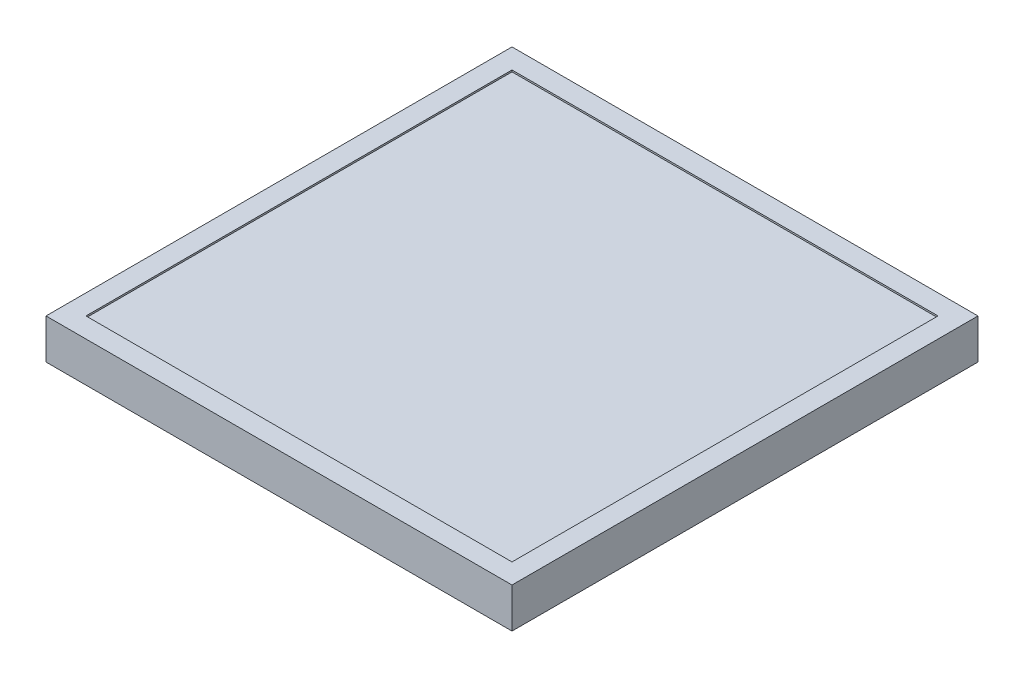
ISO-10303-21;
HEADER;
FILE_DESCRIPTION(('STEP AP214'),'2;1');
FILE_NAME('part.step','',(''),(''),'','','');
FILE_SCHEMA(('AUTOMOTIVE_DESIGN { 1 0 10303 214 1 1 1 1 }'));
ENDSEC;
DATA;
#1=APPLICATION_CONTEXT('core data for automotive mechanical design processes');
#2=APPLICATION_PROTOCOL_DEFINITION('international standard','automotive_design',2000,#1);
#3=PRODUCT_CONTEXT('',#1,'mechanical');
#4=PRODUCT('Part','Part','',(#3));
#5=PRODUCT_RELATED_PRODUCT_CATEGORY('part','',(#4));
#6=PRODUCT_DEFINITION_FORMATION('','',#4);
#7=PRODUCT_DEFINITION_CONTEXT('part definition',#1,'design');
#8=PRODUCT_DEFINITION('design','',#6,#7);
#9=PRODUCT_DEFINITION_SHAPE('','',#8);
#10=(LENGTH_UNIT() NAMED_UNIT(*) SI_UNIT(.MILLI.,.METRE.));
#11=(NAMED_UNIT(*) PLANE_ANGLE_UNIT() SI_UNIT($,.RADIAN.));
#12=(NAMED_UNIT(*) SI_UNIT($,.STERADIAN.) SOLID_ANGLE_UNIT());
#13=UNCERTAINTY_MEASURE_WITH_UNIT(LENGTH_MEASURE(1.E-05),#10,'distance_accuracy_value','');
#14=(GEOMETRIC_REPRESENTATION_CONTEXT(3) GLOBAL_UNCERTAINTY_ASSIGNED_CONTEXT((#13)) GLOBAL_UNIT_ASSIGNED_CONTEXT((#10,
#11,#12)) REPRESENTATION_CONTEXT('',''));
#15=CARTESIAN_POINT('',(0.,0.,0.));
#16=DIRECTION('',(0.,0.,1.));
#17=DIRECTION('',(1.,0.,0.));
#18=AXIS2_PLACEMENT_3D('',#15,#16,#17);
#19=CARTESIAN_POINT('',(144.143471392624,24.,145.254894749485));
#20=DIRECTION('',(-1.,0.,0.));
#21=DIRECTION('',(0.,0.,1.));
#22=AXIS2_PLACEMENT_3D('',#19,#20,#21);
#23=PLANE('',#22);
#24=DIRECTION('',(0.,0.,-1.));
#25=VECTOR('',#24,1.);
#26=CARTESIAN_POINT('',(144.143471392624,0.,145.254894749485));
#27=LINE('',#26,#25);
#28=CARTESIAN_POINT('',(144.143471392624,0.,145.254894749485));
#29=VERTEX_POINT('',#28);
#30=CARTESIAN_POINT('',(144.143471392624,0.,-134.745105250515));
#31=VERTEX_POINT('',#30);
#32=EDGE_CURVE('E158',#29,#31,#27,.T.);
#33=ORIENTED_EDGE('',*,*,#32,.T.);
#34=DIRECTION('',(0.,-1.,0.));
#35=VECTOR('',#34,1.);
#36=CARTESIAN_POINT('',(144.143471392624,24.,-134.745105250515));
#37=LINE('',#36,#35);
#38=CARTESIAN_POINT('',(144.143471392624,24.,-134.745105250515));
#39=VERTEX_POINT('',#38);
#40=EDGE_CURVE('E11',#39,#31,#37,.T.);
#41=ORIENTED_EDGE('',*,*,#40,.F.);
#42=DIRECTION('',(0.,0.,-1.));
#43=VECTOR('',#42,1.);
#44=CARTESIAN_POINT('',(144.143471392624,24.,145.254894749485));
#45=LINE('',#44,#43);
#46=CARTESIAN_POINT('',(144.143471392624,24.,145.254894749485));
#47=VERTEX_POINT('',#46);
#48=EDGE_CURVE('E164',#47,#39,#45,.T.);
#49=ORIENTED_EDGE('',*,*,#48,.F.);
#50=DIRECTION('',(0.,-1.,0.));
#51=VECTOR('',#50,1.);
#52=CARTESIAN_POINT('',(144.143471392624,24.,145.254894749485));
#53=LINE('',#52,#51);
#54=EDGE_CURVE('E174',#47,#29,#53,.T.);
#55=ORIENTED_EDGE('',*,*,#54,.T.);
#56=EDGE_LOOP('',(#33,#41,#49,#55));
#57=FACE_BOUND('',#56,.T.);
#58=ADVANCED_FACE('F39',(#57),#23,.F.);
#59=CARTESIAN_POINT('',(-135.856528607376,24.,-134.745105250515));
#60=DIRECTION('',(0.,0.,1.));
#61=DIRECTION('',(1.,0.,0.));
#62=AXIS2_PLACEMENT_3D('',#59,#60,#61);
#63=PLANE('',#62);
#64=DIRECTION('',(-1.,0.,0.));
#65=VECTOR('',#64,1.);
#66=CARTESIAN_POINT('',(-135.856528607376,0.,-134.745105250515));
#67=LINE('',#66,#65);
#68=CARTESIAN_POINT('',(-135.856528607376,0.,-134.745105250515));
#69=VERTEX_POINT('',#68);
#70=EDGE_CURVE('E178',#31,#69,#67,.T.);
#71=ORIENTED_EDGE('',*,*,#70,.T.);
#72=DIRECTION('',(0.,-1.,0.));
#73=VECTOR('',#72,1.);
#74=CARTESIAN_POINT('',(-135.856528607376,24.,-134.745105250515));
#75=LINE('',#74,#73);
#76=CARTESIAN_POINT('',(-135.856528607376,24.,-134.745105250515));
#77=VERTEX_POINT('',#76);
#78=EDGE_CURVE('E47',#77,#69,#75,.T.);
#79=ORIENTED_EDGE('',*,*,#78,.F.);
#80=DIRECTION('',(-1.,0.,0.));
#81=VECTOR('',#80,1.);
#82=CARTESIAN_POINT('',(-135.856528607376,24.,-134.745105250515));
#83=LINE('',#82,#81);
#84=EDGE_CURVE('E91',#39,#77,#83,.T.);
#85=ORIENTED_EDGE('',*,*,#84,.F.);
#86=ORIENTED_EDGE('',*,*,#40,.T.);
#87=EDGE_LOOP('',(#71,#79,#85,#86));
#88=FACE_BOUND('',#87,.T.);
#89=ADVANCED_FACE('F213',(#88),#63,.F.);
#90=CARTESIAN_POINT('',(-135.856528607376,24.,145.254894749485));
#91=DIRECTION('',(1.,0.,0.));
#92=DIRECTION('',(0.,0.,-1.));
#93=AXIS2_PLACEMENT_3D('',#90,#91,#92);
#94=PLANE('',#93);
#95=DIRECTION('',(0.,0.,1.));
#96=VECTOR('',#95,1.);
#97=CARTESIAN_POINT('',(-135.856528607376,0.,145.254894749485));
#98=LINE('',#97,#96);
#99=CARTESIAN_POINT('',(-135.856528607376,0.,145.254894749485));
#100=VERTEX_POINT('',#99);
#101=EDGE_CURVE('E181',#69,#100,#98,.T.);
#102=ORIENTED_EDGE('',*,*,#101,.T.);
#103=DIRECTION('',(0.,-1.,0.));
#104=VECTOR('',#103,1.);
#105=CARTESIAN_POINT('',(-135.856528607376,24.,145.254894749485));
#106=LINE('',#105,#104);
#107=CARTESIAN_POINT('',(-135.856528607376,24.,145.254894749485));
#108=VERTEX_POINT('',#107);
#109=EDGE_CURVE('E188',#108,#100,#106,.T.);
#110=ORIENTED_EDGE('',*,*,#109,.F.);
#111=DIRECTION('',(0.,0.,1.));
#112=VECTOR('',#111,1.);
#113=CARTESIAN_POINT('',(-135.856528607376,24.,145.254894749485));
#114=LINE('',#113,#112);
#115=EDGE_CURVE('E169',#77,#108,#114,.T.);
#116=ORIENTED_EDGE('',*,*,#115,.F.);
#117=ORIENTED_EDGE('',*,*,#78,.T.);
#118=EDGE_LOOP('',(#102,#110,#116,#117));
#119=FACE_BOUND('',#118,.T.);
#120=ADVANCED_FACE('F195',(#119),#94,.F.);
#121=CARTESIAN_POINT('',(-135.856528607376,24.,145.254894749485));
#122=DIRECTION('',(0.,0.,-1.));
#123=DIRECTION('',(-1.,0.,0.));
#124=AXIS2_PLACEMENT_3D('',#121,#122,#123);
#125=PLANE('',#124);
#126=DIRECTION('',(1.,0.,0.));
#127=VECTOR('',#126,1.);
#128=CARTESIAN_POINT('',(-135.856528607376,0.,145.254894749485));
#129=LINE('',#128,#127);
#130=EDGE_CURVE('E84',#100,#29,#129,.T.);
#131=ORIENTED_EDGE('',*,*,#130,.T.);
#132=ORIENTED_EDGE('',*,*,#54,.F.);
#133=DIRECTION('',(1.,0.,0.));
#134=VECTOR('',#133,1.);
#135=CARTESIAN_POINT('',(-135.856528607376,24.,145.254894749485));
#136=LINE('',#135,#134);
#137=EDGE_CURVE('E63',#108,#47,#136,.T.);
#138=ORIENTED_EDGE('',*,*,#137,.F.);
#139=ORIENTED_EDGE('',*,*,#109,.T.);
#140=EDGE_LOOP('',(#131,#132,#138,#139));
#141=FACE_BOUND('',#140,.T.);
#142=ADVANCED_FACE('F203',(#141),#125,.F.);
#143=CARTESIAN_POINT('',(0.,24.,0.));
#144=DIRECTION('',(0.,-1.,0.));
#145=DIRECTION('',(0.,0.,-1.));
#146=AXIS2_PLACEMENT_3D('',#143,#144,#145);
#147=PLANE('',#146);
#148=DIRECTION('',(-1.,0.,0.));
#149=VECTOR('',#148,1.);
#150=CARTESIAN_POINT('',(-123.856528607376,24.,-122.745105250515));
#151=LINE('',#150,#149);
#152=CARTESIAN_POINT('',(132.143471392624,24.,-122.745105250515));
#153=VERTEX_POINT('',#152);
#154=CARTESIAN_POINT('',(-123.856528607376,24.,-122.745105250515));
#155=VERTEX_POINT('',#154);
#156=EDGE_CURVE('E149',#153,#155,#151,.T.);
#157=ORIENTED_EDGE('',*,*,#156,.F.);
#158=DIRECTION('',(0.,0.,-1.));
#159=VECTOR('',#158,1.);
#160=CARTESIAN_POINT('',(132.143471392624,24.,133.254894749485));
#161=LINE('',#160,#159);
#162=CARTESIAN_POINT('',(132.143471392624,24.,133.254894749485));
#163=VERTEX_POINT('',#162);
#164=EDGE_CURVE('E54',#163,#153,#161,.T.);
#165=ORIENTED_EDGE('',*,*,#164,.F.);
#166=DIRECTION('',(1.,0.,0.));
#167=VECTOR('',#166,1.);
#168=CARTESIAN_POINT('',(-123.856528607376,24.,133.254894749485));
#169=LINE('',#168,#167);
#170=CARTESIAN_POINT('',(-123.856528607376,24.,133.254894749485));
#171=VERTEX_POINT('',#170);
#172=EDGE_CURVE('E136',#171,#163,#169,.T.);
#173=ORIENTED_EDGE('',*,*,#172,.F.);
#174=DIRECTION('',(0.,0.,1.));
#175=VECTOR('',#174,1.);
#176=CARTESIAN_POINT('',(-123.856528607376,24.,133.254894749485));
#177=LINE('',#176,#175);
#178=EDGE_CURVE('E140',#155,#171,#177,.T.);
#179=ORIENTED_EDGE('',*,*,#178,.F.);
#180=EDGE_LOOP('',(#157,#165,#173,#179));
#181=FACE_BOUND('',#180,.T.);
#182=ORIENTED_EDGE('',*,*,#48,.T.);
#183=ORIENTED_EDGE('',*,*,#84,.T.);
#184=ORIENTED_EDGE('',*,*,#115,.T.);
#185=ORIENTED_EDGE('',*,*,#137,.T.);
#186=EDGE_LOOP('',(#182,#183,#184,#185));
#187=FACE_BOUND('',#186,.T.);
#188=ADVANCED_FACE('F205',(#181,#187),#147,.F.);
#189=CARTESIAN_POINT('',(0.,0.,0.));
#190=DIRECTION('',(0.,-1.,0.));
#191=DIRECTION('',(0.,0.,-1.));
#192=AXIS2_PLACEMENT_3D('',#189,#190,#191);
#193=PLANE('',#192);
#194=ORIENTED_EDGE('',*,*,#32,.F.);
#195=ORIENTED_EDGE('',*,*,#130,.F.);
#196=ORIENTED_EDGE('',*,*,#101,.F.);
#197=ORIENTED_EDGE('',*,*,#70,.F.);
#198=EDGE_LOOP('',(#194,#195,#196,#197));
#199=FACE_BOUND('',#198,.T.);
#200=ADVANCED_FACE('F199',(#199),#193,.T.);
#201=CARTESIAN_POINT('',(132.143471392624,23.,133.254894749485));
#202=DIRECTION('',(1.,0.,0.));
#203=DIRECTION('',(0.,0.,-1.));
#204=AXIS2_PLACEMENT_3D('',#201,#202,#203);
#205=PLANE('',#204);
#206=ORIENTED_EDGE('',*,*,#164,.T.);
#207=DIRECTION('',(0.,1.,0.));
#208=VECTOR('',#207,1.);
#209=CARTESIAN_POINT('',(132.143471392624,23.,-122.745105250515));
#210=LINE('',#209,#208);
#211=CARTESIAN_POINT('',(132.143471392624,23.,-122.745105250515));
#212=VERTEX_POINT('',#211);
#213=EDGE_CURVE('E111',#212,#153,#210,.T.);
#214=ORIENTED_EDGE('',*,*,#213,.F.);
#215=DIRECTION('',(0.,0.,-1.));
#216=VECTOR('',#215,1.);
#217=CARTESIAN_POINT('',(132.143471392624,23.,133.254894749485));
#218=LINE('',#217,#216);
#219=CARTESIAN_POINT('',(132.143471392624,23.,133.254894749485));
#220=VERTEX_POINT('',#219);
#221=EDGE_CURVE('E115',#220,#212,#218,.T.);
#222=ORIENTED_EDGE('',*,*,#221,.F.);
#223=DIRECTION('',(0.,1.,0.));
#224=VECTOR('',#223,1.);
#225=CARTESIAN_POINT('',(132.143471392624,23.,133.254894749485));
#226=LINE('',#225,#224);
#227=EDGE_CURVE('E155',#220,#163,#226,.T.);
#228=ORIENTED_EDGE('',*,*,#227,.T.);
#229=EDGE_LOOP('',(#206,#214,#222,#228));
#230=FACE_BOUND('',#229,.T.);
#231=ADVANCED_FACE('F113',(#230),#205,.F.);
#232=CARTESIAN_POINT('',(-123.856528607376,23.,133.254894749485));
#233=DIRECTION('',(0.,0.,1.));
#234=DIRECTION('',(1.,0.,0.));
#235=AXIS2_PLACEMENT_3D('',#232,#233,#234);
#236=PLANE('',#235);
#237=ORIENTED_EDGE('',*,*,#172,.T.);
#238=ORIENTED_EDGE('',*,*,#227,.F.);
#239=DIRECTION('',(1.,0.,0.));
#240=VECTOR('',#239,1.);
#241=CARTESIAN_POINT('',(-123.856528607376,23.,133.254894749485));
#242=LINE('',#241,#240);
#243=CARTESIAN_POINT('',(-123.856528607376,23.,133.254894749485));
#244=VERTEX_POINT('',#243);
#245=EDGE_CURVE('E122',#244,#220,#242,.T.);
#246=ORIENTED_EDGE('',*,*,#245,.F.);
#247=DIRECTION('',(0.,1.,0.));
#248=VECTOR('',#247,1.);
#249=CARTESIAN_POINT('',(-123.856528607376,23.,133.254894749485));
#250=LINE('',#249,#248);
#251=EDGE_CURVE('E159',#244,#171,#250,.T.);
#252=ORIENTED_EDGE('',*,*,#251,.T.);
#253=EDGE_LOOP('',(#237,#238,#246,#252));
#254=FACE_BOUND('',#253,.T.);
#255=ADVANCED_FACE('F252',(#254),#236,.F.);
#256=CARTESIAN_POINT('',(-123.856528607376,23.,133.254894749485));
#257=DIRECTION('',(-1.,0.,0.));
#258=DIRECTION('',(0.,0.,1.));
#259=AXIS2_PLACEMENT_3D('',#256,#257,#258);
#260=PLANE('',#259);
#261=ORIENTED_EDGE('',*,*,#178,.T.);
#262=ORIENTED_EDGE('',*,*,#251,.F.);
#263=DIRECTION('',(0.,0.,1.));
#264=VECTOR('',#263,1.);
#265=CARTESIAN_POINT('',(-123.856528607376,23.,133.254894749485));
#266=LINE('',#265,#264);
#267=CARTESIAN_POINT('',(-123.856528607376,23.,-122.745105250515));
#268=VERTEX_POINT('',#267);
#269=EDGE_CURVE('E131',#268,#244,#266,.T.);
#270=ORIENTED_EDGE('',*,*,#269,.F.);
#271=DIRECTION('',(0.,1.,0.));
#272=VECTOR('',#271,1.);
#273=CARTESIAN_POINT('',(-123.856528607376,23.,-122.745105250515));
#274=LINE('',#273,#272);
#275=EDGE_CURVE('E121',#268,#155,#274,.T.);
#276=ORIENTED_EDGE('',*,*,#275,.T.);
#277=EDGE_LOOP('',(#261,#262,#270,#276));
#278=FACE_BOUND('',#277,.T.);
#279=ADVANCED_FACE('F261',(#278),#260,.F.);
#280=CARTESIAN_POINT('',(-123.856528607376,23.,-122.745105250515));
#281=DIRECTION('',(0.,0.,-1.));
#282=DIRECTION('',(-1.,0.,0.));
#283=AXIS2_PLACEMENT_3D('',#280,#281,#282);
#284=PLANE('',#283);
#285=ORIENTED_EDGE('',*,*,#156,.T.);
#286=ORIENTED_EDGE('',*,*,#275,.F.);
#287=DIRECTION('',(-1.,0.,0.));
#288=VECTOR('',#287,1.);
#289=CARTESIAN_POINT('',(-123.856528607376,23.,-122.745105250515));
#290=LINE('',#289,#288);
#291=EDGE_CURVE('E125',#212,#268,#290,.T.);
#292=ORIENTED_EDGE('',*,*,#291,.F.);
#293=ORIENTED_EDGE('',*,*,#213,.T.);
#294=EDGE_LOOP('',(#285,#286,#292,#293));
#295=FACE_BOUND('',#294,.T.);
#296=ADVANCED_FACE('F126',(#295),#284,.F.);
#297=CARTESIAN_POINT('',(0.,23.,0.));
#298=DIRECTION('',(0.,-1.,0.));
#299=DIRECTION('',(0.,0.,-1.));
#300=AXIS2_PLACEMENT_3D('',#297,#298,#299);
#301=PLANE('',#300);
#302=ORIENTED_EDGE('',*,*,#221,.T.);
#303=ORIENTED_EDGE('',*,*,#291,.T.);
#304=ORIENTED_EDGE('',*,*,#269,.T.);
#305=ORIENTED_EDGE('',*,*,#245,.T.);
#306=EDGE_LOOP('',(#302,#303,#304,#305));
#307=FACE_BOUND('',#306,.T.);
#308=ADVANCED_FACE('F133',(#307),#301,.F.);
#309=CLOSED_SHELL('',(#58,#89,#120,#142,#188,#200,#231,#255,#279,#296,#308));
#310=MANIFOLD_SOLID_BREP('B2',#309);
#311=ADVANCED_BREP_SHAPE_REPRESENTATION('',(#18,#310),#14);
#312=SHAPE_DEFINITION_REPRESENTATION(#9,#311);
ENDSEC;
END-ISO-10303-21;
